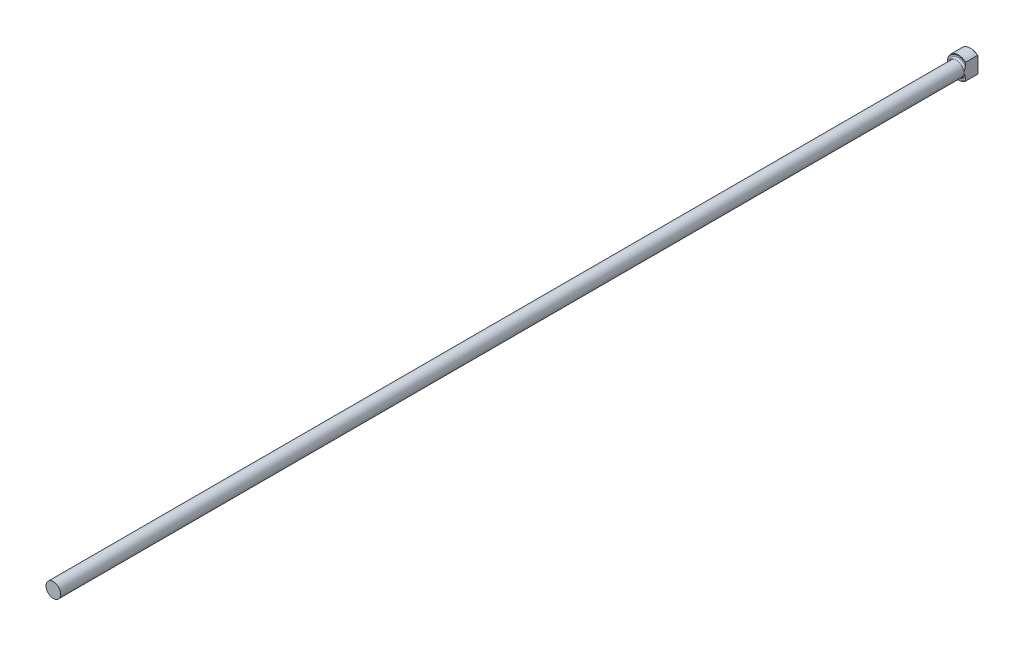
from build123d import *

# Parameters (mm, degrees)
CHAMFER1_SIZE      = 0.254
CUT_EXTRUDE1_REACH = 459.265


with BuildPart() as part:
    # Sketch1 → Revolve1 (revolve)
    with BuildSketch(Plane(origin=(0, 0, 0), x_dir=(0, 0, -1), z_dir=(1, 0, 0)), mode=Mode.PRIVATE) as revolve1_sk:
        with BuildLine():
            Line((0, 0), (0, 5.461))
            Line((0, 5.461), (-6.35, 5.461))
            Line((-6.35, 5.461), (-6.35, 4.39674))
            ThreePointArc((-6.35, 4.39674), (-6.573184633, 3.857924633), (-7.112, 3.63474))
            Line((-7.112, 3.63474), (-457.2, 3.63474))
            Line((-457.2, 3.63474), (-457.2, 0))
            Line((-457.2, 0), (0, 0))
        make_face()
    revolve(revolve1_sk.sketch.rotate(Axis((0, 0, -25.434744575), (0, 0, 1)), 90), axis=Axis((0, 0, -25.434744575), (0, 0, 1)))

    # Chamfer1
    chamfer1_edges = [part.edges().sort_by_distance(p)[0] for p in [
        (5.461, 0, 0),
        (5.461, 0, 6.35),
    ]]
    chamfer(chamfer1_edges, length=CHAMFER1_SIZE)

    # Sketch2 → Cut-Extrude1 (cut, up to next)
    with BuildSketch(Plane(origin=(0, 0, 0), x_dir=(-1, 0, 0), z_dir=(0, 0, -1)), mode=Mode.PRIVATE) as cut_extrude1_sk1:
        with BuildLine():
            Line((-3.63474, 4.07568229), (-3.63474, -4.07568229))
            ThreePointArc((-3.63474, -4.07568229), (-5.461, 0), (-3.63474, 4.07568229))
        make_face()
    cut_extrude1_tool1 = extrude(cut_extrude1_sk1.sketch, amount=-CUT_EXTRUDE1_REACH, mode=Mode.PRIVATE) & part.part
    add(cut_extrude1_tool1.solids().sort_by_distance((4.376844, 0, 0))[0], mode=Mode.SUBTRACT)


solid = part.part
